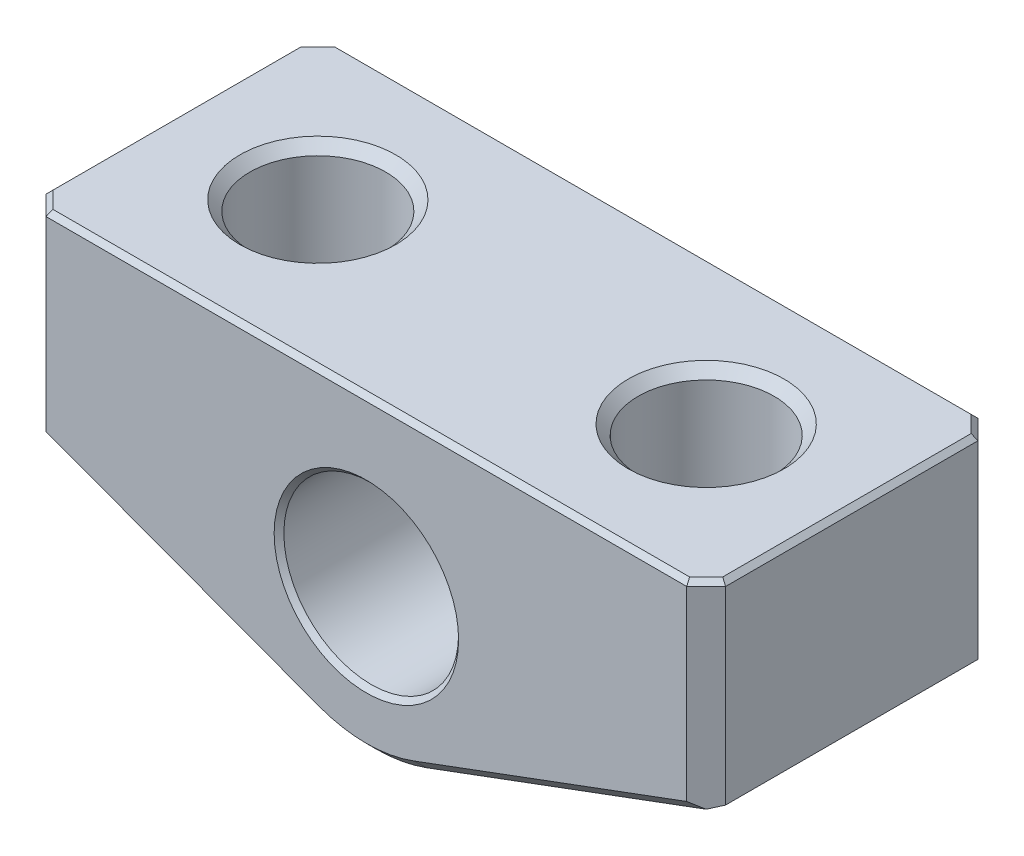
ISO-10303-21;
HEADER;
FILE_DESCRIPTION(('STEP AP214'),'2;1');
FILE_NAME('part.step','',(''),(''),'','','');
FILE_SCHEMA(('AUTOMOTIVE_DESIGN { 1 0 10303 214 1 1 1 1 }'));
ENDSEC;
DATA;
#1=APPLICATION_CONTEXT('core data for automotive mechanical design processes');
#2=APPLICATION_PROTOCOL_DEFINITION('international standard','automotive_design',2000,#1);
#3=PRODUCT_CONTEXT('',#1,'mechanical');
#4=PRODUCT('Part','Part','',(#3));
#5=PRODUCT_RELATED_PRODUCT_CATEGORY('part','',(#4));
#6=PRODUCT_DEFINITION_FORMATION('','',#4);
#7=PRODUCT_DEFINITION_CONTEXT('part definition',#1,'design');
#8=PRODUCT_DEFINITION('design','',#6,#7);
#9=PRODUCT_DEFINITION_SHAPE('','',#8);
#10=(LENGTH_UNIT() NAMED_UNIT(*) SI_UNIT(.MILLI.,.METRE.));
#11=(NAMED_UNIT(*) PLANE_ANGLE_UNIT() SI_UNIT($,.RADIAN.));
#12=(NAMED_UNIT(*) SI_UNIT($,.STERADIAN.) SOLID_ANGLE_UNIT());
#13=UNCERTAINTY_MEASURE_WITH_UNIT(LENGTH_MEASURE(1.E-05),#10,'distance_accuracy_value','');
#14=(GEOMETRIC_REPRESENTATION_CONTEXT(3) GLOBAL_UNCERTAINTY_ASSIGNED_CONTEXT((#13)) GLOBAL_UNIT_ASSIGNED_CONTEXT((#10,
#11,#12)) REPRESENTATION_CONTEXT('',''));
#15=CARTESIAN_POINT('',(0.,0.,0.));
#16=DIRECTION('',(0.,0.,1.));
#17=DIRECTION('',(1.,0.,0.));
#18=AXIS2_PLACEMENT_3D('',#15,#16,#17);
#19=CARTESIAN_POINT('',(-35.,-3.,-15.));
#20=DIRECTION('',(-1.,0.,0.));
#21=DIRECTION('',(0.,0.,1.));
#22=AXIS2_PLACEMENT_3D('',#19,#20,#21);
#23=PLANE('',#22);
#24=DIRECTION('',(0.,1.,0.));
#25=VECTOR('',#24,1.);
#26=CARTESIAN_POINT('',(-35.,-3.,13.));
#27=LINE('',#26,#25);
#28=CARTESIAN_POINT('',(-35.,-3.,13.));
#29=VERTEX_POINT('',#28);
#30=CARTESIAN_POINT('',(-35.,16.5,13.));
#31=VERTEX_POINT('',#30);
#32=EDGE_CURVE('E211',#29,#31,#27,.T.);
#33=ORIENTED_EDGE('',*,*,#32,.T.);
#34=DIRECTION('',(0.,0.,-1.));
#35=VECTOR('',#34,1.);
#36=CARTESIAN_POINT('',(-35.,16.5,-15.));
#37=LINE('',#36,#35);
#38=CARTESIAN_POINT('',(-35.,16.5,-13.));
#39=VERTEX_POINT('',#38);
#40=EDGE_CURVE('E43',#31,#39,#37,.T.);
#41=ORIENTED_EDGE('',*,*,#40,.T.);
#42=DIRECTION('',(0.,-1.,0.));
#43=VECTOR('',#42,1.);
#44=CARTESIAN_POINT('',(-35.,-3.,-13.));
#45=LINE('',#44,#43);
#46=CARTESIAN_POINT('',(-35.,-3.,-13.));
#47=VERTEX_POINT('',#46);
#48=EDGE_CURVE('E209',#39,#47,#45,.T.);
#49=ORIENTED_EDGE('',*,*,#48,.T.);
#50=DIRECTION('',(0.,0.,1.));
#51=VECTOR('',#50,1.);
#52=CARTESIAN_POINT('',(-35.,-3.,-15.));
#53=LINE('',#52,#51);
#54=EDGE_CURVE('E358',#47,#29,#53,.T.);
#55=ORIENTED_EDGE('',*,*,#54,.T.);
#56=EDGE_LOOP('',(#33,#41,#49,#55));
#57=FACE_BOUND('',#56,.T.);
#58=ADVANCED_FACE('F34',(#57),#23,.T.);
#59=CARTESIAN_POINT('',(-35.,17.,-15.));
#60=DIRECTION('',(0.,1.,0.));
#61=DIRECTION('',(0.,0.,1.));
#62=AXIS2_PLACEMENT_3D('',#59,#60,#61);
#63=PLANE('',#62);
#64=DIRECTION('',(1.,0.,0.));
#65=VECTOR('',#64,1.);
#66=CARTESIAN_POINT('',(-35.,17.,14.5));
#67=LINE('',#66,#65);
#68=CARTESIAN_POINT('',(-32.7928932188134,17.,14.5));
#69=VERTEX_POINT('',#68);
#70=CARTESIAN_POINT('',(32.7928932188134,17.,14.5));
#71=VERTEX_POINT('',#70);
#72=EDGE_CURVE('E283',#69,#71,#67,.T.);
#73=ORIENTED_EDGE('',*,*,#72,.T.);
#74=DIRECTION('',(0.707106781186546,0.,-0.707106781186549));
#75=VECTOR('',#74,1.);
#76=CARTESIAN_POINT('',(13.6464466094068,17.,33.6464466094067));
#77=LINE('',#76,#75);
#78=CARTESIAN_POINT('',(34.5,17.,12.7928932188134));
#79=VERTEX_POINT('',#78);
#80=EDGE_CURVE('E289',#71,#79,#77,.T.);
#81=ORIENTED_EDGE('',*,*,#80,.T.);
#82=DIRECTION('',(0.,0.,-1.));
#83=VECTOR('',#82,1.);
#84=CARTESIAN_POINT('',(34.5,17.,-15.));
#85=LINE('',#84,#83);
#86=CARTESIAN_POINT('',(34.5,17.,-12.7928932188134));
#87=VERTEX_POINT('',#86);
#88=EDGE_CURVE('E287',#79,#87,#85,.T.);
#89=ORIENTED_EDGE('',*,*,#88,.T.);
#90=DIRECTION('',(-0.707106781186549,0.,-0.707106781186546));
#91=VECTOR('',#90,1.);
#92=CARTESIAN_POINT('',(-1.35355339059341,17.,-48.6464466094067));
#93=LINE('',#92,#91);
#94=CARTESIAN_POINT('',(32.7928932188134,17.,-14.5));
#95=VERTEX_POINT('',#94);
#96=EDGE_CURVE('E285',#87,#95,#93,.T.);
#97=ORIENTED_EDGE('',*,*,#96,.T.);
#98=DIRECTION('',(-1.,0.,0.));
#99=VECTOR('',#98,1.);
#100=CARTESIAN_POINT('',(-33.,17.,-14.5));
#101=LINE('',#100,#99);
#102=CARTESIAN_POINT('',(-32.7928932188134,17.,-14.5));
#103=VERTEX_POINT('',#102);
#104=EDGE_CURVE('E275',#95,#103,#101,.T.);
#105=ORIENTED_EDGE('',*,*,#104,.T.);
#106=DIRECTION('',(-0.707106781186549,0.,0.707106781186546));
#107=VECTOR('',#106,1.);
#108=CARTESIAN_POINT('',(-33.6464466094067,17.,-13.6464466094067));
#109=LINE('',#108,#107);
#110=CARTESIAN_POINT('',(-34.5,17.,-12.7928932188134));
#111=VERTEX_POINT('',#110);
#112=EDGE_CURVE('E277',#103,#111,#109,.T.);
#113=ORIENTED_EDGE('',*,*,#112,.T.);
#114=DIRECTION('',(0.,0.,1.));
#115=VECTOR('',#114,1.);
#116=CARTESIAN_POINT('',(-34.5,17.,-15.));
#117=LINE('',#116,#115);
#118=CARTESIAN_POINT('',(-34.5,17.,12.7928932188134));
#119=VERTEX_POINT('',#118);
#120=EDGE_CURVE('E279',#111,#119,#117,.T.);
#121=ORIENTED_EDGE('',*,*,#120,.T.);
#122=DIRECTION('',(0.707106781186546,0.,0.707106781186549));
#123=VECTOR('',#122,1.);
#124=CARTESIAN_POINT('',(-48.6464466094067,17.,-1.35355339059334));
#125=LINE('',#124,#123);
#126=EDGE_CURVE('E281',#119,#69,#125,.T.);
#127=ORIENTED_EDGE('',*,*,#126,.T.);
#128=EDGE_LOOP('',(#73,#81,#89,#97,#105,#113,#121,#127));
#129=FACE_BOUND('',#128,.T.);
#130=CARTESIAN_POINT('',(-20.,17.,0.));
#131=DIRECTION('',(0.,1.,0.));
#132=DIRECTION('',(0.,0.,1.));
#133=AXIS2_PLACEMENT_3D('',#130,#131,#132);
#134=CIRCLE('',#133,8.025);
#135=CARTESIAN_POINT('',(-20.,17.,8.025));
#136=VERTEX_POINT('',#135);
#137=EDGE_CURVE('E255',#136,#136,#134,.T.);
#138=ORIENTED_EDGE('',*,*,#137,.F.);
#139=EDGE_LOOP('',(#138));
#140=FACE_BOUND('',#139,.T.);
#141=CARTESIAN_POINT('',(20.,17.,0.));
#142=DIRECTION('',(0.,1.,0.));
#143=DIRECTION('',(0.,0.,1.));
#144=AXIS2_PLACEMENT_3D('',#141,#142,#143);
#145=CIRCLE('',#144,8.025);
#146=CARTESIAN_POINT('',(20.,17.,8.025));
#147=VERTEX_POINT('',#146);
#148=EDGE_CURVE('E369',#147,#147,#145,.T.);
#149=ORIENTED_EDGE('',*,*,#148,.F.);
#150=EDGE_LOOP('',(#149));
#151=FACE_BOUND('',#150,.T.);
#152=ADVANCED_FACE('F394',(#129,#140,#151),#63,.T.);
#153=CARTESIAN_POINT('',(35.,17.,-15.));
#154=DIRECTION('',(1.,0.,0.));
#155=DIRECTION('',(0.,0.,-1.));
#156=AXIS2_PLACEMENT_3D('',#153,#154,#155);
#157=PLANE('',#156);
#158=DIRECTION('',(0.,1.,0.));
#159=VECTOR('',#158,1.);
#160=CARTESIAN_POINT('',(35.,17.,-13.));
#161=LINE('',#160,#159);
#162=CARTESIAN_POINT('',(35.,-3.,-13.));
#163=VERTEX_POINT('',#162);
#164=CARTESIAN_POINT('',(35.,16.5,-13.));
#165=VERTEX_POINT('',#164);
#166=EDGE_CURVE('E180',#163,#165,#161,.T.);
#167=ORIENTED_EDGE('',*,*,#166,.T.);
#168=DIRECTION('',(0.,0.,1.));
#169=VECTOR('',#168,1.);
#170=CARTESIAN_POINT('',(35.,16.5,-15.));
#171=LINE('',#170,#169);
#172=CARTESIAN_POINT('',(35.,16.5,13.));
#173=VERTEX_POINT('',#172);
#174=EDGE_CURVE('E295',#165,#173,#171,.T.);
#175=ORIENTED_EDGE('',*,*,#174,.T.);
#176=DIRECTION('',(0.,-1.,0.));
#177=VECTOR('',#176,1.);
#178=CARTESIAN_POINT('',(35.,17.,13.));
#179=LINE('',#178,#177);
#180=CARTESIAN_POINT('',(35.,-3.,13.));
#181=VERTEX_POINT('',#180);
#182=EDGE_CURVE('E183',#173,#181,#179,.T.);
#183=ORIENTED_EDGE('',*,*,#182,.T.);
#184=DIRECTION('',(0.,0.,1.));
#185=VECTOR('',#184,1.);
#186=CARTESIAN_POINT('',(35.,-3.,-15.));
#187=LINE('',#186,#185);
#188=EDGE_CURVE('E165',#163,#181,#187,.T.);
#189=ORIENTED_EDGE('',*,*,#188,.F.);
#190=EDGE_LOOP('',(#167,#175,#183,#189));
#191=FACE_BOUND('',#190,.T.);
#192=ADVANCED_FACE('F179',(#191),#157,.T.);
#193=CARTESIAN_POINT('',(35.,-3.,-15.));
#194=DIRECTION('',(0.348221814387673,-0.937412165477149,0.));
#195=DIRECTION('',(0.937412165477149,0.348221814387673,0.));
#196=AXIS2_PLACEMENT_3D('',#193,#194,#195);
#197=PLANE('',#196);
#198=CARTESIAN_POINT('',(20.,-8.57207107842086,0.));
#199=DIRECTION('',(0.348221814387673,-0.937412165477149,0.));
#200=DIRECTION('',(0.937412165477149,0.348221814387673,0.));
#201=AXIS2_PLACEMENT_3D('',#198,#199,#200);
#202=ELLIPSE('',#201,7.4673662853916,6.99999999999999);
#203=CARTESIAN_POINT('',(27.,-5.97177124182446,0.));
#204=VERTEX_POINT('',#203);
#205=EDGE_CURVE('E362',#204,#204,#202,.T.);
#206=ORIENTED_EDGE('',*,*,#205,.F.);
#207=EDGE_LOOP('',(#206));
#208=FACE_BOUND('',#207,.T.);
#209=DIRECTION('',(0.683907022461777,0.254051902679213,-0.68390702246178));
#210=VECTOR('',#209,1.);
#211=CARTESIAN_POINT('',(48.096406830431,1.86494064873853,-0.0964068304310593));
#212=LINE('',#211,#210);
#213=CARTESIAN_POINT('',(34.,-3.37147140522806,14.));
#214=VERTEX_POINT('',#213);
#215=EDGE_CURVE('E175',#181,#214,#212,.F.);
#216=ORIENTED_EDGE('',*,*,#215,.T.);
#217=DIRECTION('',(-0.937412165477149,-0.348221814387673,0.));
#218=VECTOR('',#217,1.);
#219=CARTESIAN_POINT('',(35.,-3.,14.));
#220=LINE('',#219,#218);
#221=CARTESIAN_POINT('',(5.22332721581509,-14.0611824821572,14.));
#222=VERTEX_POINT('',#221);
#223=EDGE_CURVE('E223',#214,#222,#220,.T.);
#224=ORIENTED_EDGE('',*,*,#223,.T.);
#225=DIRECTION('',(0.,0.,1.));
#226=VECTOR('',#225,1.);
#227=CARTESIAN_POINT('',(5.22332721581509,-14.0611824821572,-15.));
#228=LINE('',#227,#226);
#229=CARTESIAN_POINT('',(5.22332721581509,-14.0611824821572,-14.));
#230=VERTEX_POINT('',#229);
#231=EDGE_CURVE('E184',#230,#222,#228,.T.);
#232=ORIENTED_EDGE('',*,*,#231,.F.);
#233=DIRECTION('',(0.937412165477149,0.348221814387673,0.));
#234=VECTOR('',#233,1.);
#235=CARTESIAN_POINT('',(33.,-3.74294281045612,-14.));
#236=LINE('',#235,#234);
#237=CARTESIAN_POINT('',(34.,-3.37147140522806,-14.));
#238=VERTEX_POINT('',#237);
#239=EDGE_CURVE('E169',#230,#238,#236,.T.);
#240=ORIENTED_EDGE('',*,*,#239,.T.);
#241=DIRECTION('',(0.68390702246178,0.254051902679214,0.683907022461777));
#242=VECTOR('',#241,1.);
#243=CARTESIAN_POINT('',(34.0645423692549,-3.34749576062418,-13.9354576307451));
#244=LINE('',#243,#242);
#245=EDGE_CURVE('E161',#238,#163,#244,.T.);
#246=ORIENTED_EDGE('',*,*,#245,.T.);
#247=ORIENTED_EDGE('',*,*,#188,.T.);
#248=EDGE_LOOP('',(#216,#224,#232,#240,#246,#247));
#249=FACE_BOUND('',#248,.T.);
#250=ADVANCED_FACE('F164',(#208,#249),#197,.T.);
#251=CARTESIAN_POINT('',(0.,0.,-15.));
#252=DIRECTION('',(0.,0.,1.));
#253=DIRECTION('',(1.,0.,0.));
#254=AXIS2_PLACEMENT_3D('',#251,#252,#253);
#255=CYLINDRICAL_SURFACE('',#254,15.);
#256=ORIENTED_EDGE('',*,*,#231,.T.);
#257=CARTESIAN_POINT('',(0.,0.,14.));
#258=DIRECTION('',(0.,0.,1.));
#259=DIRECTION('',(1.,0.,0.));
#260=AXIS2_PLACEMENT_3D('',#257,#258,#259);
#261=CIRCLE('',#260,15.);
#262=CARTESIAN_POINT('',(-5.2233272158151,-14.0611824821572,14.));
#263=VERTEX_POINT('',#262);
#264=EDGE_CURVE('E227',#222,#263,#261,.F.);
#265=ORIENTED_EDGE('',*,*,#264,.T.);
#266=DIRECTION('',(0.,0.,1.));
#267=VECTOR('',#266,1.);
#268=CARTESIAN_POINT('',(-5.2233272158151,-14.0611824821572,-15.));
#269=LINE('',#268,#267);
#270=CARTESIAN_POINT('',(-5.2233272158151,-14.0611824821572,-14.));
#271=VERTEX_POINT('',#270);
#272=EDGE_CURVE('E353',#271,#263,#269,.T.);
#273=ORIENTED_EDGE('',*,*,#272,.F.);
#274=CARTESIAN_POINT('',(0.,0.,-14.));
#275=DIRECTION('',(0.,0.,1.));
#276=DIRECTION('',(1.,0.,0.));
#277=AXIS2_PLACEMENT_3D('',#274,#275,#276);
#278=CIRCLE('',#277,15.);
#279=EDGE_CURVE('E225',#271,#230,#278,.T.);
#280=ORIENTED_EDGE('',*,*,#279,.T.);
#281=EDGE_LOOP('',(#256,#265,#273,#280));
#282=FACE_BOUND('',#281,.T.);
#283=ADVANCED_FACE('F356',(#282),#255,.T.);
#284=CARTESIAN_POINT('',(-5.22332721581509,-14.0611824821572,-15.));
#285=DIRECTION('',(-0.348221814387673,-0.937412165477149,0.));
#286=DIRECTION('',(0.937412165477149,-0.348221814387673,0.));
#287=AXIS2_PLACEMENT_3D('',#284,#285,#286);
#288=PLANE('',#287);
#289=CARTESIAN_POINT('',(-20.,-8.57207107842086,0.));
#290=DIRECTION('',(-0.348221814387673,-0.937412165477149,0.));
#291=DIRECTION('',(-0.937412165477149,0.348221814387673,0.));
#292=AXIS2_PLACEMENT_3D('',#289,#290,#291);
#293=ELLIPSE('',#292,7.4673662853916,6.99999999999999);
#294=CARTESIAN_POINT('',(-27.,-5.97177124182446,0.));
#295=VERTEX_POINT('',#294);
#296=EDGE_CURVE('E367',#295,#295,#293,.T.);
#297=ORIENTED_EDGE('',*,*,#296,.F.);
#298=EDGE_LOOP('',(#297));
#299=FACE_BOUND('',#298,.T.);
#300=ORIENTED_EDGE('',*,*,#272,.T.);
#301=DIRECTION('',(-0.937412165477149,0.348221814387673,0.));
#302=VECTOR('',#301,1.);
#303=CARTESIAN_POINT('',(-5.22332721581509,-14.0611824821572,14.));
#304=LINE('',#303,#302);
#305=CARTESIAN_POINT('',(-34.,-3.37147140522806,14.));
#306=VERTEX_POINT('',#305);
#307=EDGE_CURVE('E232',#263,#306,#304,.T.);
#308=ORIENTED_EDGE('',*,*,#307,.T.);
#309=DIRECTION('',(0.683907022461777,-0.254051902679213,0.68390702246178));
#310=VECTOR('',#309,1.);
#311=CARTESIAN_POINT('',(-32.2471419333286,-4.02260805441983,15.7528580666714));
#312=LINE('',#311,#310);
#313=EDGE_CURVE('E207',#306,#29,#312,.F.);
#314=ORIENTED_EDGE('',*,*,#313,.T.);
#315=ORIENTED_EDGE('',*,*,#54,.F.);
#316=DIRECTION('',(0.68390702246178,-0.254051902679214,-0.683907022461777));
#317=VECTOR('',#316,1.);
#318=CARTESIAN_POINT('',(-18.2152774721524,-9.23504446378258,-29.7847225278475));
#319=LINE('',#318,#317);
#320=CARTESIAN_POINT('',(-34.,-3.37147140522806,-14.));
#321=VERTEX_POINT('',#320);
#322=EDGE_CURVE('E204',#47,#321,#319,.T.);
#323=ORIENTED_EDGE('',*,*,#322,.T.);
#324=DIRECTION('',(0.937412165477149,-0.348221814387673,0.));
#325=VECTOR('',#324,1.);
#326=CARTESIAN_POINT('',(-5.2233272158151,-14.0611824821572,-14.));
#327=LINE('',#326,#325);
#328=EDGE_CURVE('E229',#321,#271,#327,.T.);
#329=ORIENTED_EDGE('',*,*,#328,.T.);
#330=EDGE_LOOP('',(#300,#308,#314,#315,#323,#329));
#331=FACE_BOUND('',#330,.T.);
#332=ADVANCED_FACE('F352',(#299,#331),#288,.T.);
#333=CARTESIAN_POINT('',(0.,0.,-15.));
#334=DIRECTION('',(0.,0.,1.));
#335=DIRECTION('',(1.,0.,0.));
#336=AXIS2_PLACEMENT_3D('',#333,#334,#335);
#337=PLANE('',#336);
#338=CARTESIAN_POINT('',(0.,0.,-15.));
#339=DIRECTION('',(0.,0.,1.));
#340=DIRECTION('',(1.,0.,0.));
#341=AXIS2_PLACEMENT_3D('',#338,#339,#340);
#342=CIRCLE('',#341,9.49999999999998);
#343=CARTESIAN_POINT('',(9.49999999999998,0.,-15.));
#344=VERTEX_POINT('',#343);
#345=EDGE_CURVE('E272',#344,#344,#342,.T.);
#346=ORIENTED_EDGE('',*,*,#345,.T.);
#347=EDGE_LOOP('',(#346));
#348=FACE_BOUND('',#347,.T.);
#349=DIRECTION('',(0.,1.,0.));
#350=VECTOR('',#349,1.);
#351=CARTESIAN_POINT('',(-33.,17.,-15.));
#352=LINE('',#351,#350);
#353=CARTESIAN_POINT('',(-33.,-2.67617619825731,-15.));
#354=VERTEX_POINT('',#353);
#355=CARTESIAN_POINT('',(-33.,16.5,-15.));
#356=VERTEX_POINT('',#355);
#357=EDGE_CURVE('E190',#354,#356,#352,.T.);
#358=ORIENTED_EDGE('',*,*,#357,.T.);
#359=DIRECTION('',(1.,0.,0.));
#360=VECTOR('',#359,1.);
#361=CARTESIAN_POINT('',(33.,16.5,-15.));
#362=LINE('',#361,#360);
#363=CARTESIAN_POINT('',(33.,16.5,-15.));
#364=VERTEX_POINT('',#363);
#365=EDGE_CURVE('E270',#356,#364,#362,.T.);
#366=ORIENTED_EDGE('',*,*,#365,.T.);
#367=DIRECTION('',(0.,-1.,0.));
#368=VECTOR('',#367,1.);
#369=CARTESIAN_POINT('',(33.,-3.,-15.));
#370=LINE('',#369,#368);
#371=CARTESIAN_POINT('',(33.,-2.6761761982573,-15.));
#372=VERTEX_POINT('',#371);
#373=EDGE_CURVE('E193',#364,#372,#370,.T.);
#374=ORIENTED_EDGE('',*,*,#373,.T.);
#375=DIRECTION('',(-0.937412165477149,-0.348221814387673,0.));
#376=VECTOR('',#375,1.);
#377=CARTESIAN_POINT('',(4.87510540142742,-13.1237703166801,-15.));
#378=LINE('',#377,#376);
#379=CARTESIAN_POINT('',(4.87510540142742,-13.1237703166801,-15.));
#380=VERTEX_POINT('',#379);
#381=EDGE_CURVE('E237',#372,#380,#378,.T.);
#382=ORIENTED_EDGE('',*,*,#381,.T.);
#383=CARTESIAN_POINT('',(0.,0.,-15.));
#384=DIRECTION('',(0.,0.,1.));
#385=DIRECTION('',(1.,0.,0.));
#386=AXIS2_PLACEMENT_3D('',#383,#384,#385);
#387=CIRCLE('',#386,14.);
#388=CARTESIAN_POINT('',(-4.87510540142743,-13.1237703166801,-15.));
#389=VERTEX_POINT('',#388);
#390=EDGE_CURVE('E239',#380,#389,#387,.F.);
#391=ORIENTED_EDGE('',*,*,#390,.T.);
#392=DIRECTION('',(-0.937412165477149,0.348221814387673,0.));
#393=VECTOR('',#392,1.);
#394=CARTESIAN_POINT('',(-32.6517781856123,-2.80553064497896,-15.));
#395=LINE('',#394,#393);
#396=EDGE_CURVE('E241',#389,#354,#395,.T.);
#397=ORIENTED_EDGE('',*,*,#396,.T.);
#398=EDGE_LOOP('',(#358,#366,#374,#382,#391,#397));
#399=FACE_BOUND('',#398,.T.);
#400=ADVANCED_FACE('F336',(#348,#399),#337,.F.);
#401=CARTESIAN_POINT('',(0.,0.,-15.));
#402=DIRECTION('',(0.,0.,1.));
#403=DIRECTION('',(1.,0.,0.));
#404=AXIS2_PLACEMENT_3D('',#401,#402,#403);
#405=CYLINDRICAL_SURFACE('',#404,9.);
#406=CARTESIAN_POINT('',(0.,0.,14.5));
#407=DIRECTION('',(0.,0.,1.));
#408=DIRECTION('',(1.,0.,0.));
#409=AXIS2_PLACEMENT_3D('',#406,#407,#408);
#410=CIRCLE('',#409,9.);
#411=CARTESIAN_POINT('',(9.,0.,14.5));
#412=VERTEX_POINT('',#411);
#413=EDGE_CURVE('E262',#412,#412,#410,.T.);
#414=ORIENTED_EDGE('',*,*,#413,.T.);
#415=EDGE_LOOP('',(#414));
#416=FACE_BOUND('',#415,.T.);
#417=CARTESIAN_POINT('',(0.,0.,-14.5));
#418=DIRECTION('',(0.,0.,1.));
#419=DIRECTION('',(1.,0.,0.));
#420=AXIS2_PLACEMENT_3D('',#417,#418,#419);
#421=CIRCLE('',#420,9.);
#422=CARTESIAN_POINT('',(9.,0.,-14.5));
#423=VERTEX_POINT('',#422);
#424=EDGE_CURVE('E247',#423,#423,#421,.F.);
#425=ORIENTED_EDGE('',*,*,#424,.T.);
#426=EDGE_LOOP('',(#425));
#427=FACE_BOUND('',#426,.T.);
#428=ADVANCED_FACE('F566',(#416,#427),#405,.F.);
#429=CARTESIAN_POINT('',(0.,0.,15.));
#430=DIRECTION('',(0.,0.,1.));
#431=DIRECTION('',(1.,0.,0.));
#432=AXIS2_PLACEMENT_3D('',#429,#430,#431);
#433=PLANE('',#432);
#434=CARTESIAN_POINT('',(0.,0.,15.));
#435=DIRECTION('',(0.,0.,1.));
#436=DIRECTION('',(1.,0.,0.));
#437=AXIS2_PLACEMENT_3D('',#434,#435,#436);
#438=CIRCLE('',#437,9.50000000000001);
#439=CARTESIAN_POINT('',(9.50000000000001,0.,15.));
#440=VERTEX_POINT('',#439);
#441=EDGE_CURVE('E267',#440,#440,#438,.F.);
#442=ORIENTED_EDGE('',*,*,#441,.T.);
#443=EDGE_LOOP('',(#442));
#444=FACE_BOUND('',#443,.T.);
#445=DIRECTION('',(0.,1.,0.));
#446=VECTOR('',#445,1.);
#447=CARTESIAN_POINT('',(33.,0.,15.));
#448=LINE('',#447,#446);
#449=CARTESIAN_POINT('',(33.,-2.6761761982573,15.));
#450=VERTEX_POINT('',#449);
#451=CARTESIAN_POINT('',(33.,16.5,15.));
#452=VERTEX_POINT('',#451);
#453=EDGE_CURVE('E201',#450,#452,#448,.T.);
#454=ORIENTED_EDGE('',*,*,#453,.T.);
#455=DIRECTION('',(-1.,0.,0.));
#456=VECTOR('',#455,1.);
#457=CARTESIAN_POINT('',(0.,16.5,15.));
#458=LINE('',#457,#456);
#459=CARTESIAN_POINT('',(-33.,16.5,15.));
#460=VERTEX_POINT('',#459);
#461=EDGE_CURVE('E265',#452,#460,#458,.T.);
#462=ORIENTED_EDGE('',*,*,#461,.T.);
#463=DIRECTION('',(0.,-1.,0.));
#464=VECTOR('',#463,1.);
#465=CARTESIAN_POINT('',(-33.,0.,15.));
#466=LINE('',#465,#464);
#467=CARTESIAN_POINT('',(-33.,-2.6761761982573,15.));
#468=VERTEX_POINT('',#467);
#469=EDGE_CURVE('E174',#460,#468,#466,.T.);
#470=ORIENTED_EDGE('',*,*,#469,.T.);
#471=DIRECTION('',(0.937412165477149,-0.348221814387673,0.));
#472=VECTOR('',#471,1.);
#473=CARTESIAN_POINT('',(-4.87510540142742,-13.1237703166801,15.));
#474=LINE('',#473,#472);
#475=CARTESIAN_POINT('',(-4.87510540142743,-13.1237703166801,15.));
#476=VERTEX_POINT('',#475);
#477=EDGE_CURVE('E213',#468,#476,#474,.T.);
#478=ORIENTED_EDGE('',*,*,#477,.T.);
#479=CARTESIAN_POINT('',(0.,0.,15.));
#480=DIRECTION('',(0.,0.,1.));
#481=DIRECTION('',(1.,0.,0.));
#482=AXIS2_PLACEMENT_3D('',#479,#480,#481);
#483=CIRCLE('',#482,14.);
#484=CARTESIAN_POINT('',(4.87510540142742,-13.1237703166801,15.));
#485=VERTEX_POINT('',#484);
#486=EDGE_CURVE('E215',#476,#485,#483,.T.);
#487=ORIENTED_EDGE('',*,*,#486,.T.);
#488=DIRECTION('',(0.937412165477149,0.348221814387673,0.));
#489=VECTOR('',#488,1.);
#490=CARTESIAN_POINT('',(4.87510540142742,-13.1237703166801,15.));
#491=LINE('',#490,#489);
#492=EDGE_CURVE('E217',#485,#450,#491,.T.);
#493=ORIENTED_EDGE('',*,*,#492,.T.);
#494=EDGE_LOOP('',(#454,#462,#470,#478,#487,#493));
#495=FACE_BOUND('',#494,.T.);
#496=ADVANCED_FACE('F560',(#444,#495),#433,.T.);
#497=CARTESIAN_POINT('',(20.,17.,0.));
#498=DIRECTION('',(0.,1.,0.));
#499=DIRECTION('',(0.,0.,1.));
#500=AXIS2_PLACEMENT_3D('',#497,#498,#499);
#501=CYLINDRICAL_SURFACE('',#500,6.99999999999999);
#502=ORIENTED_EDGE('',*,*,#205,.T.);
#503=EDGE_LOOP('',(#502));
#504=FACE_BOUND('',#503,.T.);
#505=CARTESIAN_POINT('',(20.,15.975,0.));
#506=DIRECTION('',(0.,1.,0.));
#507=DIRECTION('',(0.,0.,1.));
#508=AXIS2_PLACEMENT_3D('',#505,#506,#507);
#509=CIRCLE('',#508,7.);
#510=CARTESIAN_POINT('',(20.,15.975,7.));
#511=VERTEX_POINT('',#510);
#512=EDGE_CURVE('E366',#511,#511,#509,.T.);
#513=ORIENTED_EDGE('',*,*,#512,.T.);
#514=EDGE_LOOP('',(#513));
#515=FACE_BOUND('',#514,.T.);
#516=ADVANCED_FACE('F385',(#504,#515),#501,.F.);
#517=CARTESIAN_POINT('',(20.,17.,0.));
#518=DIRECTION('',(0.,1.,0.));
#519=DIRECTION('',(0.,0.,1.));
#520=AXIS2_PLACEMENT_3D('',#517,#518,#519);
#521=CONICAL_SURFACE('',#520,8.025,0.785398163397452);
#522=ORIENTED_EDGE('',*,*,#512,.F.);
#523=EDGE_LOOP('',(#522));
#524=FACE_BOUND('',#523,.T.);
#525=ORIENTED_EDGE('',*,*,#148,.T.);
#526=EDGE_LOOP('',(#525));
#527=FACE_BOUND('',#526,.T.);
#528=ADVANCED_FACE('F387',(#524,#527),#521,.F.);
#529=CARTESIAN_POINT('',(-20.,17.,0.));
#530=DIRECTION('',(0.,1.,0.));
#531=DIRECTION('',(0.,0.,1.));
#532=AXIS2_PLACEMENT_3D('',#529,#530,#531);
#533=CYLINDRICAL_SURFACE('',#532,6.99999999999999);
#534=ORIENTED_EDGE('',*,*,#296,.T.);
#535=EDGE_LOOP('',(#534));
#536=FACE_BOUND('',#535,.T.);
#537=CARTESIAN_POINT('',(-20.,15.975,0.));
#538=DIRECTION('',(0.,1.,0.));
#539=DIRECTION('',(0.,0.,1.));
#540=AXIS2_PLACEMENT_3D('',#537,#538,#539);
#541=CIRCLE('',#540,7.);
#542=CARTESIAN_POINT('',(-20.,15.975,7.));
#543=VERTEX_POINT('',#542);
#544=EDGE_CURVE('E370',#543,#543,#541,.T.);
#545=ORIENTED_EDGE('',*,*,#544,.T.);
#546=EDGE_LOOP('',(#545));
#547=FACE_BOUND('',#546,.T.);
#548=ADVANCED_FACE('F390',(#536,#547),#533,.F.);
#549=CARTESIAN_POINT('',(-20.,17.,0.));
#550=DIRECTION('',(0.,1.,0.));
#551=DIRECTION('',(0.,0.,1.));
#552=AXIS2_PLACEMENT_3D('',#549,#550,#551);
#553=CONICAL_SURFACE('',#552,8.025,0.785398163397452);
#554=ORIENTED_EDGE('',*,*,#544,.F.);
#555=EDGE_LOOP('',(#554));
#556=FACE_BOUND('',#555,.T.);
#557=ORIENTED_EDGE('',*,*,#137,.T.);
#558=EDGE_LOOP('',(#557));
#559=FACE_BOUND('',#558,.T.);
#560=ADVANCED_FACE('F419',(#556,#559),#553,.F.);
#561=CARTESIAN_POINT('',(35.,17.,-13.));
#562=DIRECTION('',(0.707106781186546,0.,-0.707106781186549));
#563=DIRECTION('',(-0.707106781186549,0.,-0.707106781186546));
#564=AXIS2_PLACEMENT_3D('',#561,#562,#563);
#565=PLANE('',#564);
#566=ORIENTED_EDGE('',*,*,#373,.F.);
#567=DIRECTION('',(0.707106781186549,0.,0.707106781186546));
#568=VECTOR('',#567,1.);
#569=CARTESIAN_POINT('',(35.,16.5,-13.));
#570=LINE('',#569,#568);
#571=EDGE_CURVE('E189',#364,#165,#570,.T.);
#572=ORIENTED_EDGE('',*,*,#571,.T.);
#573=ORIENTED_EDGE('',*,*,#166,.F.);
#574=ORIENTED_EDGE('',*,*,#245,.F.);
#575=DIRECTION('',(-0.634561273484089,0.441207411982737,-0.634561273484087));
#576=VECTOR('',#575,1.);
#577=CARTESIAN_POINT('',(29.1018712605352,0.0341740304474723,-18.8981287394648));
#578=LINE('',#577,#576);
#579=EDGE_CURVE('E245',#238,#372,#578,.T.);
#580=ORIENTED_EDGE('',*,*,#579,.T.);
#581=EDGE_LOOP('',(#566,#572,#573,#574,#580));
#582=FACE_BOUND('',#581,.T.);
#583=ADVANCED_FACE('F187',(#582),#565,.T.);
#584=CARTESIAN_POINT('',(33.,0.,15.));
#585=DIRECTION('',(-0.707106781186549,0.,-0.707106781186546));
#586=DIRECTION('',(-0.707106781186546,0.,0.707106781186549));
#587=AXIS2_PLACEMENT_3D('',#584,#585,#586);
#588=PLANE('',#587);
#589=ORIENTED_EDGE('',*,*,#182,.F.);
#590=DIRECTION('',(0.707106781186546,0.,-0.707106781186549));
#591=VECTOR('',#590,1.);
#592=CARTESIAN_POINT('',(33.,16.5,15.));
#593=LINE('',#592,#591);
#594=EDGE_CURVE('E292',#173,#452,#593,.F.);
#595=ORIENTED_EDGE('',*,*,#594,.T.);
#596=ORIENTED_EDGE('',*,*,#453,.F.);
#597=DIRECTION('',(0.634561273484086,-0.44120741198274,-0.634561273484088));
#598=VECTOR('',#597,1.);
#599=CARTESIAN_POINT('',(32.2507425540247,-2.15522108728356,15.7492574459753));
#600=LINE('',#599,#598);
#601=EDGE_CURVE('E220',#450,#214,#600,.T.);
#602=ORIENTED_EDGE('',*,*,#601,.T.);
#603=ORIENTED_EDGE('',*,*,#215,.F.);
#604=EDGE_LOOP('',(#589,#595,#596,#602,#603));
#605=FACE_BOUND('',#604,.T.);
#606=ADVANCED_FACE('F418',(#605),#588,.F.);
#607=CARTESIAN_POINT('',(-33.,0.,15.));
#608=DIRECTION('',(0.707106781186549,0.,-0.707106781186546));
#609=DIRECTION('',(-0.707106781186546,0.,-0.707106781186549));
#610=AXIS2_PLACEMENT_3D('',#607,#608,#609);
#611=PLANE('',#610);
#612=ORIENTED_EDGE('',*,*,#469,.F.);
#613=DIRECTION('',(0.707106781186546,0.,0.707106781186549));
#614=VECTOR('',#613,1.);
#615=CARTESIAN_POINT('',(-33.,16.5,15.));
#616=LINE('',#615,#614);
#617=EDGE_CURVE('E58',#460,#31,#616,.F.);
#618=ORIENTED_EDGE('',*,*,#617,.T.);
#619=ORIENTED_EDGE('',*,*,#32,.F.);
#620=ORIENTED_EDGE('',*,*,#313,.F.);
#621=DIRECTION('',(0.634561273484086,0.441207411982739,0.634561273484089));
#622=VECTOR('',#621,1.);
#623=CARTESIAN_POINT('',(-32.2507425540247,-2.15522108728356,15.7492574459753));
#624=LINE('',#623,#622);
#625=EDGE_CURVE('E234',#306,#468,#624,.T.);
#626=ORIENTED_EDGE('',*,*,#625,.T.);
#627=EDGE_LOOP('',(#612,#618,#619,#620,#626));
#628=FACE_BOUND('',#627,.T.);
#629=ADVANCED_FACE('F422',(#628),#611,.F.);
#630=CARTESIAN_POINT('',(-35.,-3.,-13.));
#631=DIRECTION('',(-0.707106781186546,0.,-0.707106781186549));
#632=DIRECTION('',(-0.707106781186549,0.,0.707106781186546));
#633=AXIS2_PLACEMENT_3D('',#630,#631,#632);
#634=PLANE('',#633);
#635=ORIENTED_EDGE('',*,*,#48,.F.);
#636=DIRECTION('',(0.707106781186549,0.,-0.707106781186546));
#637=VECTOR('',#636,1.);
#638=CARTESIAN_POINT('',(-35.,16.5,-13.));
#639=LINE('',#638,#637);
#640=EDGE_CURVE('E11',#39,#356,#639,.T.);
#641=ORIENTED_EDGE('',*,*,#640,.T.);
#642=ORIENTED_EDGE('',*,*,#357,.F.);
#643=DIRECTION('',(-0.634561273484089,-0.441207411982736,0.634561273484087));
#644=VECTOR('',#643,1.);
#645=CARTESIAN_POINT('',(-34.7013340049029,-3.85910557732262,-13.2986659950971));
#646=LINE('',#645,#644);
#647=EDGE_CURVE('E243',#354,#321,#646,.T.);
#648=ORIENTED_EDGE('',*,*,#647,.T.);
#649=ORIENTED_EDGE('',*,*,#322,.F.);
#650=EDGE_LOOP('',(#635,#641,#642,#648,#649));
#651=FACE_BOUND('',#650,.T.);
#652=ADVANCED_FACE('F332',(#651),#634,.T.);
#653=CARTESIAN_POINT('',(-4.87510540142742,-13.1237703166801,15.));
#654=DIRECTION('',(0.246230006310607,0.662850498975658,-0.707106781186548));
#655=DIRECTION('',(0.,0.729569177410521,0.683907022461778));
#656=AXIS2_PLACEMENT_3D('',#653,#654,#655);
#657=PLANE('',#656);
#658=ORIENTED_EDGE('',*,*,#625,.F.);
#659=ORIENTED_EDGE('',*,*,#307,.F.);
#660=DIRECTION('',(-0.246230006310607,-0.662850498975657,-0.707106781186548));
#661=VECTOR('',#660,1.);
#662=CARTESIAN_POINT('',(-4.87510540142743,-13.1237703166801,15.));
#663=LINE('',#662,#661);
#664=EDGE_CURVE('E251',#476,#263,#663,.T.);
#665=ORIENTED_EDGE('',*,*,#664,.F.);
#666=ORIENTED_EDGE('',*,*,#477,.F.);
#667=EDGE_LOOP('',(#658,#659,#665,#666));
#668=FACE_BOUND('',#667,.T.);
#669=ADVANCED_FACE('F428',(#668),#657,.F.);
#670=CARTESIAN_POINT('',(0.,0.,15.));
#671=DIRECTION('',(0.,0.,-1.));
#672=DIRECTION('',(-1.,0.,0.));
#673=AXIS2_PLACEMENT_3D('',#670,#671,#672);
#674=CONICAL_SURFACE('',#673,14.,0.78539816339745);
#675=ORIENTED_EDGE('',*,*,#664,.T.);
#676=ORIENTED_EDGE('',*,*,#264,.F.);
#677=DIRECTION('',(0.246230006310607,-0.662850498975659,-0.707106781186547));
#678=VECTOR('',#677,1.);
#679=CARTESIAN_POINT('',(4.87510540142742,-13.1237703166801,15.));
#680=LINE('',#679,#678);
#681=EDGE_CURVE('E248',#485,#222,#680,.T.);
#682=ORIENTED_EDGE('',*,*,#681,.F.);
#683=ORIENTED_EDGE('',*,*,#486,.F.);
#684=EDGE_LOOP('',(#675,#676,#682,#683));
#685=FACE_BOUND('',#684,.T.);
#686=ADVANCED_FACE('F433',(#685),#674,.T.);
#687=CARTESIAN_POINT('',(4.87510540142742,-13.1237703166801,15.));
#688=DIRECTION('',(-0.246230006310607,0.662850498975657,-0.707106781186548));
#689=DIRECTION('',(0.,0.729569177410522,0.683907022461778));
#690=AXIS2_PLACEMENT_3D('',#687,#688,#689);
#691=PLANE('',#690);
#692=ORIENTED_EDGE('',*,*,#681,.T.);
#693=ORIENTED_EDGE('',*,*,#223,.F.);
#694=ORIENTED_EDGE('',*,*,#601,.F.);
#695=ORIENTED_EDGE('',*,*,#492,.F.);
#696=EDGE_LOOP('',(#692,#693,#694,#695));
#697=FACE_BOUND('',#696,.T.);
#698=ADVANCED_FACE('F429',(#697),#691,.F.);
#699=CARTESIAN_POINT('',(35.,-3.,-14.));
#700=DIRECTION('',(0.246230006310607,-0.662850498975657,-0.707106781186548));
#701=DIRECTION('',(0.,0.729569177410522,-0.683907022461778));
#702=AXIS2_PLACEMENT_3D('',#699,#700,#701);
#703=PLANE('',#702);
#704=ORIENTED_EDGE('',*,*,#579,.F.);
#705=ORIENTED_EDGE('',*,*,#239,.F.);
#706=DIRECTION('',(0.246230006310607,-0.662850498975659,0.707106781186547));
#707=VECTOR('',#706,1.);
#708=CARTESIAN_POINT('',(4.87510540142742,-13.1237703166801,-15.));
#709=LINE('',#708,#707);
#710=EDGE_CURVE('E252',#380,#230,#709,.T.);
#711=ORIENTED_EDGE('',*,*,#710,.F.);
#712=ORIENTED_EDGE('',*,*,#381,.F.);
#713=EDGE_LOOP('',(#704,#705,#711,#712));
#714=FACE_BOUND('',#713,.T.);
#715=ADVANCED_FACE('F432',(#714),#703,.T.);
#716=CARTESIAN_POINT('',(0.,0.,-14.));
#717=DIRECTION('',(0.,0.,1.));
#718=DIRECTION('',(1.,0.,0.));
#719=AXIS2_PLACEMENT_3D('',#716,#717,#718);
#720=CONICAL_SURFACE('',#719,15.,0.785398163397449);
#721=ORIENTED_EDGE('',*,*,#710,.T.);
#722=ORIENTED_EDGE('',*,*,#279,.F.);
#723=DIRECTION('',(-0.246230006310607,-0.662850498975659,0.707106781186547));
#724=VECTOR('',#723,1.);
#725=CARTESIAN_POINT('',(-4.87510540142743,-13.1237703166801,-15.));
#726=LINE('',#725,#724);
#727=EDGE_CURVE('E256',#389,#271,#726,.T.);
#728=ORIENTED_EDGE('',*,*,#727,.F.);
#729=ORIENTED_EDGE('',*,*,#390,.F.);
#730=EDGE_LOOP('',(#721,#722,#728,#729));
#731=FACE_BOUND('',#730,.T.);
#732=ADVANCED_FACE('F345',(#731),#720,.T.);
#733=CARTESIAN_POINT('',(-5.22332721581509,-14.0611824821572,-14.));
#734=DIRECTION('',(-0.246230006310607,-0.662850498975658,-0.707106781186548));
#735=DIRECTION('',(0.,0.729569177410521,-0.683907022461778));
#736=AXIS2_PLACEMENT_3D('',#733,#734,#735);
#737=PLANE('',#736);
#738=ORIENTED_EDGE('',*,*,#647,.F.);
#739=ORIENTED_EDGE('',*,*,#396,.F.);
#740=ORIENTED_EDGE('',*,*,#727,.T.);
#741=ORIENTED_EDGE('',*,*,#328,.F.);
#742=EDGE_LOOP('',(#738,#739,#740,#741));
#743=FACE_BOUND('',#742,.T.);
#744=ADVANCED_FACE('F341',(#743),#737,.T.);
#745=CARTESIAN_POINT('',(0.,0.,14.5));
#746=DIRECTION('',(0.,0.,1.));
#747=DIRECTION('',(1.,0.,0.));
#748=AXIS2_PLACEMENT_3D('',#745,#746,#747);
#749=CONICAL_SURFACE('',#748,9.,0.78539816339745);
#750=ORIENTED_EDGE('',*,*,#441,.F.);
#751=EDGE_LOOP('',(#750));
#752=FACE_BOUND('',#751,.T.);
#753=ORIENTED_EDGE('',*,*,#413,.F.);
#754=EDGE_LOOP('',(#753));
#755=FACE_BOUND('',#754,.T.);
#756=ADVANCED_FACE('F443',(#752,#755),#749,.F.);
#757=CARTESIAN_POINT('',(0.,0.,-15.));
#758=DIRECTION('',(0.,0.,-1.));
#759=DIRECTION('',(-1.,0.,0.));
#760=AXIS2_PLACEMENT_3D('',#757,#758,#759);
#761=CONICAL_SURFACE('',#760,9.49999999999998,0.785398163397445);
#762=ORIENTED_EDGE('',*,*,#424,.F.);
#763=EDGE_LOOP('',(#762));
#764=FACE_BOUND('',#763,.T.);
#765=ORIENTED_EDGE('',*,*,#345,.F.);
#766=EDGE_LOOP('',(#765));
#767=FACE_BOUND('',#766,.T.);
#768=ADVANCED_FACE('F451',(#764,#767),#761,.F.);
#769=CARTESIAN_POINT('',(-33.6464466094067,17.,-13.6464466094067));
#770=DIRECTION('',(0.5,-0.707106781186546,0.500000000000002));
#771=DIRECTION('',(0.,-0.577350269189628,-0.816496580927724));
#772=AXIS2_PLACEMENT_3D('',#769,#770,#771);
#773=PLANE('',#772);
#774=DIRECTION('',(-0.281084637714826,-0.678598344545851,-0.678598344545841));
#775=VECTOR('',#774,1.);
#776=CARTESIAN_POINT('',(-32.967273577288,16.5790085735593,-14.9209914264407));
#777=LINE('',#776,#775);
#778=EDGE_CURVE('E315',#356,#103,#777,.F.);
#779=ORIENTED_EDGE('',*,*,#778,.F.);
#780=ORIENTED_EDGE('',*,*,#640,.F.);
#781=DIRECTION('',(0.678598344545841,0.67859834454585,0.281084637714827));
#782=VECTOR('',#781,1.);
#783=CARTESIAN_POINT('',(-34.2697521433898,17.2302478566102,-12.6975214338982));
#784=LINE('',#783,#782);
#785=EDGE_CURVE('E38',#111,#39,#784,.F.);
#786=ORIENTED_EDGE('',*,*,#785,.F.);
#787=ORIENTED_EDGE('',*,*,#112,.F.);
#788=EDGE_LOOP('',(#779,#780,#786,#787));
#789=FACE_BOUND('',#788,.T.);
#790=ADVANCED_FACE('F36',(#789),#773,.F.);
#791=CARTESIAN_POINT('',(-34.5,17.,-15.));
#792=DIRECTION('',(0.707106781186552,-0.707106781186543,0.));
#793=DIRECTION('',(0.707106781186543,0.707106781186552,0.));
#794=AXIS2_PLACEMENT_3D('',#791,#792,#793);
#795=PLANE('',#794);
#796=ORIENTED_EDGE('',*,*,#785,.T.);
#797=ORIENTED_EDGE('',*,*,#40,.F.);
#798=DIRECTION('',(-0.678598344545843,-0.678598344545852,0.281084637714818));
#799=VECTOR('',#798,1.);
#800=CARTESIAN_POINT('',(-29.1986843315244,22.3013156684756,10.5970163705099));
#801=LINE('',#800,#799);
#802=EDGE_CURVE('E313',#119,#31,#801,.T.);
#803=ORIENTED_EDGE('',*,*,#802,.F.);
#804=ORIENTED_EDGE('',*,*,#120,.F.);
#805=EDGE_LOOP('',(#796,#797,#803,#804));
#806=FACE_BOUND('',#805,.T.);
#807=ADVANCED_FACE('F325',(#806),#795,.F.);
#808=CARTESIAN_POINT('',(-35.,17.,-14.5));
#809=DIRECTION('',(0.,0.707106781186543,-0.707106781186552));
#810=DIRECTION('',(0.,0.707106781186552,0.707106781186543));
#811=AXIS2_PLACEMENT_3D('',#808,#809,#810);
#812=PLANE('',#811);
#813=ORIENTED_EDGE('',*,*,#778,.T.);
#814=ORIENTED_EDGE('',*,*,#104,.F.);
#815=DIRECTION('',(-0.281084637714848,0.678598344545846,0.678598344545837));
#816=VECTOR('',#815,1.);
#817=CARTESIAN_POINT('',(27.4366734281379,29.9310584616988,-1.5689415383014));
#818=LINE('',#817,#816);
#819=EDGE_CURVE('E310',#364,#95,#818,.T.);
#820=ORIENTED_EDGE('',*,*,#819,.F.);
#821=ORIENTED_EDGE('',*,*,#365,.F.);
#822=EDGE_LOOP('',(#813,#814,#820,#821));
#823=FACE_BOUND('',#822,.T.);
#824=ADVANCED_FACE('F475',(#823),#812,.T.);
#825=CARTESIAN_POINT('',(-48.6464466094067,17.,-1.35355339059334));
#826=DIRECTION('',(-0.500000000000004,0.707106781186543,0.500000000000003));
#827=DIRECTION('',(-0.816496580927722,-0.577350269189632,0.));
#828=AXIS2_PLACEMENT_3D('',#825,#826,#827);
#829=PLANE('',#828);
#830=ORIENTED_EDGE('',*,*,#802,.T.);
#831=ORIENTED_EDGE('',*,*,#617,.F.);
#832=DIRECTION('',(-0.281084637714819,-0.678598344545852,0.678598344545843));
#833=VECTOR('',#832,1.);
#834=CARTESIAN_POINT('',(-31.0214964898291,21.2765300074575,10.2234699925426));
#835=LINE('',#834,#833);
#836=EDGE_CURVE('E307',#69,#460,#835,.T.);
#837=ORIENTED_EDGE('',*,*,#836,.F.);
#838=ORIENTED_EDGE('',*,*,#126,.F.);
#839=EDGE_LOOP('',(#830,#831,#837,#838));
#840=FACE_BOUND('',#839,.T.);
#841=ADVANCED_FACE('F471',(#840),#829,.T.);
#842=CARTESIAN_POINT('',(-1.35355339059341,17.,-48.6464466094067));
#843=DIRECTION('',(-0.499999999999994,-0.707106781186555,0.499999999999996));
#844=DIRECTION('',(0.,-0.577350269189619,-0.816496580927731));
#845=AXIS2_PLACEMENT_3D('',#842,#843,#844);
#846=PLANE('',#845);
#847=ORIENTED_EDGE('',*,*,#819,.T.);
#848=ORIENTED_EDGE('',*,*,#96,.F.);
#849=DIRECTION('',(0.678598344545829,-0.678598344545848,-0.28108463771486));
#850=VECTOR('',#849,1.);
#851=CARTESIAN_POINT('',(24.8284271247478,26.6715728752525,-8.78679656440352));
#852=LINE('',#851,#850);
#853=EDGE_CURVE('E304',#165,#87,#852,.F.);
#854=ORIENTED_EDGE('',*,*,#853,.F.);
#855=ORIENTED_EDGE('',*,*,#571,.F.);
#856=EDGE_LOOP('',(#847,#848,#854,#855));
#857=FACE_BOUND('',#856,.T.);
#858=ADVANCED_FACE('F467',(#857),#846,.F.);
#859=CARTESIAN_POINT('',(0.,16.5,15.));
#860=DIRECTION('',(0.,-0.707106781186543,-0.707106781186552));
#861=DIRECTION('',(0.,0.707106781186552,-0.707106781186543));
#862=AXIS2_PLACEMENT_3D('',#859,#860,#861);
#863=PLANE('',#862);
#864=ORIENTED_EDGE('',*,*,#836,.T.);
#865=ORIENTED_EDGE('',*,*,#461,.F.);
#866=DIRECTION('',(0.281084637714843,-0.678598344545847,0.678598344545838));
#867=VECTOR('',#866,1.);
#868=CARTESIAN_POINT('',(30.3927170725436,22.7945378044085,8.70546219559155));
#869=LINE('',#868,#867);
#870=EDGE_CURVE('E302',#71,#452,#869,.T.);
#871=ORIENTED_EDGE('',*,*,#870,.F.);
#872=ORIENTED_EDGE('',*,*,#72,.F.);
#873=EDGE_LOOP('',(#864,#865,#871,#872));
#874=FACE_BOUND('',#873,.T.);
#875=ADVANCED_FACE('F463',(#874),#863,.F.);
#876=CARTESIAN_POINT('',(35.,16.5,-15.));
#877=DIRECTION('',(-0.707106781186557,-0.707106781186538,0.));
#878=DIRECTION('',(0.707106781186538,-0.707106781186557,0.));
#879=AXIS2_PLACEMENT_3D('',#876,#877,#878);
#880=PLANE('',#879);
#881=ORIENTED_EDGE('',*,*,#853,.T.);
#882=ORIENTED_EDGE('',*,*,#88,.F.);
#883=DIRECTION('',(-0.678598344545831,0.67859834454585,-0.281084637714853));
#884=VECTOR('',#883,1.);
#885=CARTESIAN_POINT('',(29.6591800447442,21.8408199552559,10.7877599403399));
#886=LINE('',#885,#884);
#887=EDGE_CURVE('E300',#173,#79,#886,.T.);
#888=ORIENTED_EDGE('',*,*,#887,.F.);
#889=ORIENTED_EDGE('',*,*,#174,.F.);
#890=EDGE_LOOP('',(#881,#882,#888,#889));
#891=FACE_BOUND('',#890,.T.);
#892=ADVANCED_FACE('F459',(#891),#880,.F.);
#893=CARTESIAN_POINT('',(13.6464466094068,17.,33.6464466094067));
#894=DIRECTION('',(0.499999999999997,0.707106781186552,0.499999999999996));
#895=DIRECTION('',(-0.816496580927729,0.577350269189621,0.));
#896=AXIS2_PLACEMENT_3D('',#893,#894,#895);
#897=PLANE('',#896);
#898=ORIENTED_EDGE('',*,*,#870,.T.);
#899=ORIENTED_EDGE('',*,*,#594,.F.);
#900=ORIENTED_EDGE('',*,*,#887,.T.);
#901=ORIENTED_EDGE('',*,*,#80,.F.);
#902=EDGE_LOOP('',(#898,#899,#900,#901));
#903=FACE_BOUND('',#902,.T.);
#904=ADVANCED_FACE('F456',(#903),#897,.T.);
#905=CLOSED_SHELL('',(#58,#152,#192,#250,#283,#332,#400,#428,#496,#516,#528,#548,#560,#583,#606,
#629,#652,#669,#686,#698,#715,#732,#744,#756,#768,#790,#807,#824,#841,#858,#875,#892,#904));
#906=MANIFOLD_SOLID_BREP('B2',#905);
#907=ADVANCED_BREP_SHAPE_REPRESENTATION('',(#18,#906),#14);
#908=SHAPE_DEFINITION_REPRESENTATION(#9,#907);
ENDSEC;
END-ISO-10303-21;
